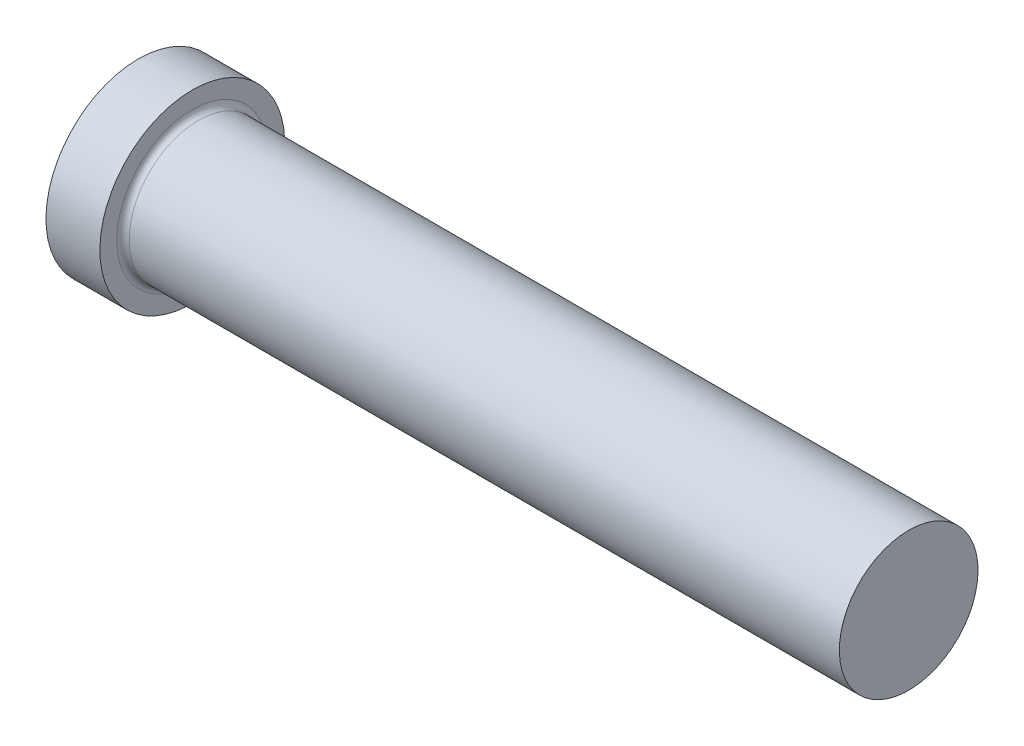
ISO-10303-21;
HEADER;
FILE_DESCRIPTION(('STEP AP214'),'2;1');
FILE_NAME('part.step','',(''),(''),'','','');
FILE_SCHEMA(('AUTOMOTIVE_DESIGN { 1 0 10303 214 1 1 1 1 }'));
ENDSEC;
DATA;
#1=APPLICATION_CONTEXT('core data for automotive mechanical design processes');
#2=APPLICATION_PROTOCOL_DEFINITION('international standard','automotive_design',2000,#1);
#3=PRODUCT_CONTEXT('',#1,'mechanical');
#4=PRODUCT('Part','Part','',(#3));
#5=PRODUCT_RELATED_PRODUCT_CATEGORY('part','',(#4));
#6=PRODUCT_DEFINITION_FORMATION('','',#4);
#7=PRODUCT_DEFINITION_CONTEXT('part definition',#1,'design');
#8=PRODUCT_DEFINITION('design','',#6,#7);
#9=PRODUCT_DEFINITION_SHAPE('','',#8);
#10=(LENGTH_UNIT() NAMED_UNIT(*) SI_UNIT(.MILLI.,.METRE.));
#11=(NAMED_UNIT(*) PLANE_ANGLE_UNIT() SI_UNIT($,.RADIAN.));
#12=(NAMED_UNIT(*) SI_UNIT($,.STERADIAN.) SOLID_ANGLE_UNIT());
#13=UNCERTAINTY_MEASURE_WITH_UNIT(LENGTH_MEASURE(1.E-05),#10,'distance_accuracy_value','');
#14=(GEOMETRIC_REPRESENTATION_CONTEXT(3) GLOBAL_UNCERTAINTY_ASSIGNED_CONTEXT((#13)) GLOBAL_UNIT_ASSIGNED_CONTEXT((#10,
#11,#12)) REPRESENTATION_CONTEXT('',''));
#15=CARTESIAN_POINT('',(0.,0.,0.));
#16=DIRECTION('',(0.,0.,1.));
#17=DIRECTION('',(1.,0.,0.));
#18=AXIS2_PLACEMENT_3D('',#15,#16,#17);
#19=CARTESIAN_POINT('',(0.,0.,0.));
#20=DIRECTION('',(-1.,0.,0.));
#21=DIRECTION('',(0.,-1.,0.));
#22=AXIS2_PLACEMENT_3D('',#19,#20,#21);
#23=PLANE('',#22);
#24=CARTESIAN_POINT('',(0.,0.,0.));
#25=DIRECTION('',(1.,0.,0.));
#26=DIRECTION('',(0.,1.,0.));
#27=AXIS2_PLACEMENT_3D('',#24,#25,#26);
#28=CIRCLE('',#27,12.);
#29=CARTESIAN_POINT('',(0.,12.,0.));
#30=VERTEX_POINT('',#29);
#31=EDGE_CURVE('E24',#30,#30,#28,.T.);
#32=ORIENTED_EDGE('',*,*,#31,.F.);
#33=EDGE_LOOP('',(#32));
#34=FACE_BOUND('',#33,.T.);
#35=ADVANCED_FACE('F13',(#34),#23,.T.);
#36=CARTESIAN_POINT('',(100.,0.,0.));
#37=DIRECTION('',(1.,0.,0.));
#38=DIRECTION('',(0.,1.,0.));
#39=AXIS2_PLACEMENT_3D('',#36,#37,#38);
#40=CYLINDRICAL_SURFACE('',#39,12.);
#41=ORIENTED_EDGE('',*,*,#31,.T.);
#42=EDGE_LOOP('',(#41));
#43=FACE_BOUND('',#42,.T.);
#44=CARTESIAN_POINT('',(7.,0.,0.));
#45=DIRECTION('',(1.,0.,0.));
#46=DIRECTION('',(0.,1.,0.));
#47=AXIS2_PLACEMENT_3D('',#44,#45,#46);
#48=CIRCLE('',#47,12.);
#49=CARTESIAN_POINT('',(7.00000000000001,12.,0.));
#50=VERTEX_POINT('',#49);
#51=EDGE_CURVE('E28',#50,#50,#48,.T.);
#52=ORIENTED_EDGE('',*,*,#51,.F.);
#53=EDGE_LOOP('',(#52));
#54=FACE_BOUND('',#53,.T.);
#55=ADVANCED_FACE('F50',(#43,#54),#40,.T.);
#56=CARTESIAN_POINT('',(7.,12.,0.));
#57=DIRECTION('',(1.,0.,0.));
#58=DIRECTION('',(0.,1.,0.));
#59=AXIS2_PLACEMENT_3D('',#56,#57,#58);
#60=PLANE('',#59);
#61=CARTESIAN_POINT('',(7.,0.,0.));
#62=DIRECTION('',(1.,0.,0.));
#63=DIRECTION('',(0.,1.,0.));
#64=AXIS2_PLACEMENT_3D('',#61,#62,#63);
#65=CIRCLE('',#64,9.8);
#66=CARTESIAN_POINT('',(7.00000000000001,9.79999999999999,0.));
#67=VERTEX_POINT('',#66);
#68=EDGE_CURVE('E8',#67,#67,#65,.F.);
#69=ORIENTED_EDGE('',*,*,#68,.T.);
#70=EDGE_LOOP('',(#69));
#71=FACE_BOUND('',#70,.T.);
#72=ORIENTED_EDGE('',*,*,#51,.T.);
#73=EDGE_LOOP('',(#72));
#74=FACE_BOUND('',#73,.T.);
#75=ADVANCED_FACE('F41',(#71,#74),#60,.T.);
#76=CARTESIAN_POINT('',(100.,0.,0.));
#77=DIRECTION('',(1.,0.,0.));
#78=DIRECTION('',(0.,1.,0.));
#79=AXIS2_PLACEMENT_3D('',#76,#77,#78);
#80=CYLINDRICAL_SURFACE('',#79,9.);
#81=CARTESIAN_POINT('',(7.8,0.,0.));
#82=DIRECTION('',(1.,0.,0.));
#83=DIRECTION('',(0.,1.,0.));
#84=AXIS2_PLACEMENT_3D('',#81,#82,#83);
#85=CIRCLE('',#84,9.);
#86=CARTESIAN_POINT('',(7.80000000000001,8.99999999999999,0.));
#87=VERTEX_POINT('',#86);
#88=EDGE_CURVE('E20',#87,#87,#85,.T.);
#89=ORIENTED_EDGE('',*,*,#88,.T.);
#90=EDGE_LOOP('',(#89));
#91=FACE_BOUND('',#90,.T.);
#92=CARTESIAN_POINT('',(100.,0.,0.));
#93=DIRECTION('',(1.,0.,0.));
#94=DIRECTION('',(0.,1.,0.));
#95=AXIS2_PLACEMENT_3D('',#92,#93,#94);
#96=CIRCLE('',#95,9.);
#97=CARTESIAN_POINT('',(100.,8.99999999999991,0.));
#98=VERTEX_POINT('',#97);
#99=EDGE_CURVE('E33',#98,#98,#96,.T.);
#100=ORIENTED_EDGE('',*,*,#99,.F.);
#101=EDGE_LOOP('',(#100));
#102=FACE_BOUND('',#101,.T.);
#103=ADVANCED_FACE('F39',(#91,#102),#80,.T.);
#104=CARTESIAN_POINT('',(100.,8.9999999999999,0.));
#105=DIRECTION('',(1.,0.,0.));
#106=DIRECTION('',(0.,1.,0.));
#107=AXIS2_PLACEMENT_3D('',#104,#105,#106);
#108=PLANE('',#107);
#109=ORIENTED_EDGE('',*,*,#99,.T.);
#110=EDGE_LOOP('',(#109));
#111=FACE_BOUND('',#110,.T.);
#112=ADVANCED_FACE('F37',(#111),#108,.T.);
#113=CARTESIAN_POINT('',(7.8,0.,0.));
#114=DIRECTION('',(1.,0.,0.));
#115=DIRECTION('',(0.,1.,0.));
#116=AXIS2_PLACEMENT_3D('',#113,#114,#115);
#117=TOROIDAL_SURFACE('',#116,9.8,0.8);
#118=ORIENTED_EDGE('',*,*,#68,.F.);
#119=EDGE_LOOP('',(#118));
#120=FACE_BOUND('',#119,.T.);
#121=ORIENTED_EDGE('',*,*,#88,.F.);
#122=EDGE_LOOP('',(#121));
#123=FACE_BOUND('',#122,.T.);
#124=ADVANCED_FACE('F15',(#120,#123),#117,.F.);
#125=CLOSED_SHELL('',(#35,#55,#75,#103,#112,#124));
#126=MANIFOLD_SOLID_BREP('B1',#125);
#127=ADVANCED_BREP_SHAPE_REPRESENTATION('',(#18,#126),#14);
#128=SHAPE_DEFINITION_REPRESENTATION(#9,#127);
ENDSEC;
END-ISO-10303-21;
